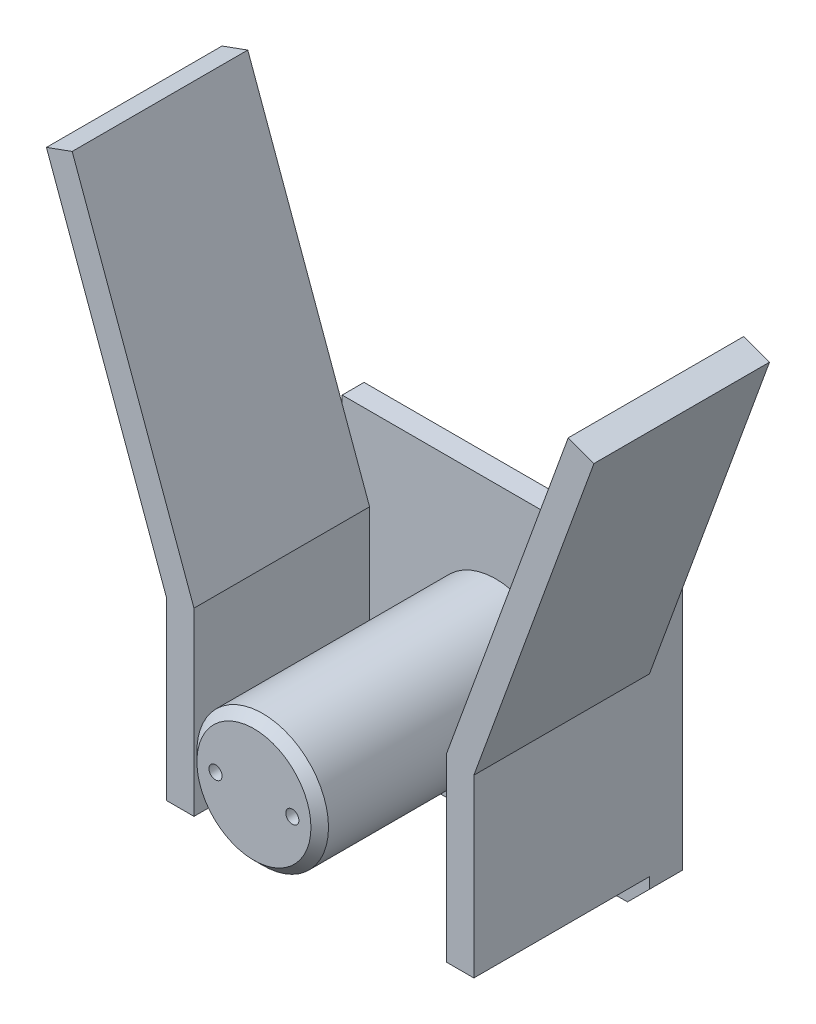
ISO-10303-21;
HEADER;
FILE_DESCRIPTION(('STEP AP214'),'2;1');
FILE_NAME('part.step','',(''),(''),'','','');
FILE_SCHEMA(('AUTOMOTIVE_DESIGN { 1 0 10303 214 1 1 1 1 }'));
ENDSEC;
DATA;
#1=APPLICATION_CONTEXT('core data for automotive mechanical design processes');
#2=APPLICATION_PROTOCOL_DEFINITION('international standard','automotive_design',2000,#1);
#3=PRODUCT_CONTEXT('',#1,'mechanical');
#4=PRODUCT('Part','Part','',(#3));
#5=PRODUCT_RELATED_PRODUCT_CATEGORY('part','',(#4));
#6=PRODUCT_DEFINITION_FORMATION('','',#4);
#7=PRODUCT_DEFINITION_CONTEXT('part definition',#1,'design');
#8=PRODUCT_DEFINITION('design','',#6,#7);
#9=PRODUCT_DEFINITION_SHAPE('','',#8);
#10=(LENGTH_UNIT() NAMED_UNIT(*) SI_UNIT(.MILLI.,.METRE.));
#11=(NAMED_UNIT(*) PLANE_ANGLE_UNIT() SI_UNIT($,.RADIAN.));
#12=(NAMED_UNIT(*) SI_UNIT($,.STERADIAN.) SOLID_ANGLE_UNIT());
#13=UNCERTAINTY_MEASURE_WITH_UNIT(LENGTH_MEASURE(1.E-05),#10,'distance_accuracy_value','');
#14=(GEOMETRIC_REPRESENTATION_CONTEXT(3) GLOBAL_UNCERTAINTY_ASSIGNED_CONTEXT((#13)) GLOBAL_UNIT_ASSIGNED_CONTEXT((#10,
#11,#12)) REPRESENTATION_CONTEXT('',''));
#15=CARTESIAN_POINT('',(0.,0.,0.));
#16=DIRECTION('',(0.,0.,1.));
#17=DIRECTION('',(1.,0.,0.));
#18=AXIS2_PLACEMENT_3D('',#15,#16,#17);
#19=CARTESIAN_POINT('',(-44.45,-85.725,9.525));
#20=DIRECTION('',(0.,0.,1.));
#21=DIRECTION('',(1.,0.,0.));
#22=AXIS2_PLACEMENT_3D('',#19,#20,#21);
#23=PLANE('',#22);
#24=DIRECTION('',(0.342020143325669,0.939692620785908,0.));
#25=VECTOR('',#24,1.);
#26=CARTESIAN_POINT('',(71.7523704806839,72.7832115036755,9.525));
#27=LINE('',#26,#25);
#28=CARTESIAN_POINT('',(36.51504,-24.0305583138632,9.525));
#29=VERTEX_POINT('',#28);
#30=CARTESIAN_POINT('',(44.45,-2.22943488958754,9.525));
#31=VERTEX_POINT('',#30);
#32=EDGE_CURVE('E198',#29,#31,#27,.T.);
#33=ORIENTED_EDGE('',*,*,#32,.T.);
#34=DIRECTION('',(0.,1.,0.));
#35=VECTOR('',#34,1.);
#36=CARTESIAN_POINT('',(44.45,0.,9.525));
#37=LINE('',#36,#35);
#38=CARTESIAN_POINT('',(44.45,0.,9.525));
#39=VERTEX_POINT('',#38);
#40=EDGE_CURVE('E328',#31,#39,#37,.T.);
#41=ORIENTED_EDGE('',*,*,#40,.T.);
#42=DIRECTION('',(-1.,0.,0.));
#43=VECTOR('',#42,1.);
#44=CARTESIAN_POINT('',(-44.45,0.,9.525));
#45=LINE('',#44,#43);
#46=CARTESIAN_POINT('',(-44.45,0.,9.525));
#47=VERTEX_POINT('',#46);
#48=EDGE_CURVE('E331',#39,#47,#45,.T.);
#49=ORIENTED_EDGE('',*,*,#48,.T.);
#50=DIRECTION('',(0.,-1.,0.));
#51=VECTOR('',#50,1.);
#52=CARTESIAN_POINT('',(-44.45,0.,9.525));
#53=LINE('',#52,#51);
#54=CARTESIAN_POINT('',(-44.45,-2.22943488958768,9.525));
#55=VERTEX_POINT('',#54);
#56=EDGE_CURVE('E321',#47,#55,#53,.T.);
#57=ORIENTED_EDGE('',*,*,#56,.T.);
#58=DIRECTION('',(-0.342020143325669,0.939692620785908,0.));
#59=VECTOR('',#58,1.);
#60=CARTESIAN_POINT('',(-71.7523704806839,72.7832115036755,9.525));
#61=LINE('',#60,#59);
#62=CARTESIAN_POINT('',(-36.51504,-24.0305583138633,9.525));
#63=VERTEX_POINT('',#62);
#64=EDGE_CURVE('E234',#63,#55,#61,.T.);
#65=ORIENTED_EDGE('',*,*,#64,.F.);
#66=DIRECTION('',(0.,1.,0.));
#67=VECTOR('',#66,1.);
#68=CARTESIAN_POINT('',(-36.51504,-24.0305583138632,9.525));
#69=LINE('',#68,#67);
#70=CARTESIAN_POINT('',(-36.51504,-76.2,9.525));
#71=VERTEX_POINT('',#70);
#72=EDGE_CURVE('E230',#71,#63,#69,.T.);
#73=ORIENTED_EDGE('',*,*,#72,.F.);
#74=DIRECTION('',(1.,0.,0.));
#75=VECTOR('',#74,1.);
#76=CARTESIAN_POINT('',(-44.45,-76.2,9.525));
#77=LINE('',#76,#75);
#78=CARTESIAN_POINT('',(-44.45,-76.2,9.525));
#79=VERTEX_POINT('',#78);
#80=EDGE_CURVE('E227',#79,#71,#77,.T.);
#81=ORIENTED_EDGE('',*,*,#80,.F.);
#82=CARTESIAN_POINT('',(-44.45,-79.3749999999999,9.525));
#83=VERTEX_POINT('',#82);
#84=EDGE_CURVE('E320',#79,#83,#53,.T.);
#85=ORIENTED_EDGE('',*,*,#84,.T.);
#86=DIRECTION('',(-0.70710678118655,0.707106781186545,0.));
#87=VECTOR('',#86,1.);
#88=CARTESIAN_POINT('',(-41.2749999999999,-82.5499999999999,9.525));
#89=LINE('',#88,#87);
#90=CARTESIAN_POINT('',(-38.0999999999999,-85.725,9.525));
#91=VERTEX_POINT('',#90);
#92=EDGE_CURVE('E353',#83,#91,#89,.F.);
#93=ORIENTED_EDGE('',*,*,#92,.T.);
#94=DIRECTION('',(1.,0.,0.));
#95=VECTOR('',#94,1.);
#96=CARTESIAN_POINT('',(-44.45,-85.725,9.525));
#97=LINE('',#96,#95);
#98=CARTESIAN_POINT('',(38.0999999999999,-85.725,9.525));
#99=VERTEX_POINT('',#98);
#100=EDGE_CURVE('E324',#91,#99,#97,.T.);
#101=ORIENTED_EDGE('',*,*,#100,.T.);
#102=DIRECTION('',(-0.707106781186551,-0.707106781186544,0.));
#103=VECTOR('',#102,1.);
#104=CARTESIAN_POINT('',(-3.17500000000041,-127.,9.525));
#105=LINE('',#104,#103);
#106=CARTESIAN_POINT('',(44.45,-79.3749999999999,9.525));
#107=VERTEX_POINT('',#106);
#108=EDGE_CURVE('E355',#99,#107,#105,.F.);
#109=ORIENTED_EDGE('',*,*,#108,.T.);
#110=CARTESIAN_POINT('',(44.45,-76.2,9.525));
#111=VERTEX_POINT('',#110);
#112=EDGE_CURVE('E329',#107,#111,#37,.T.);
#113=ORIENTED_EDGE('',*,*,#112,.T.);
#114=DIRECTION('',(-1.,0.,0.));
#115=VECTOR('',#114,1.);
#116=CARTESIAN_POINT('',(44.45,-76.2,9.525));
#117=LINE('',#116,#115);
#118=CARTESIAN_POINT('',(36.51504,-76.2,9.525));
#119=VERTEX_POINT('',#118);
#120=EDGE_CURVE('E50',#111,#119,#117,.T.);
#121=ORIENTED_EDGE('',*,*,#120,.T.);
#122=DIRECTION('',(0.,1.,0.));
#123=VECTOR('',#122,1.);
#124=CARTESIAN_POINT('',(36.51504,-24.0305583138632,9.525));
#125=LINE('',#124,#123);
#126=EDGE_CURVE('E45',#119,#29,#125,.T.);
#127=ORIENTED_EDGE('',*,*,#126,.T.);
#128=EDGE_LOOP('',(#33,#41,#49,#57,#65,#73,#81,#85,#93,#101,#109,#113,#121,#127));
#129=FACE_BOUND('',#128,.T.);
#130=CARTESIAN_POINT('',(0.,-42.8625,9.525));
#131=DIRECTION('',(0.,0.,1.));
#132=DIRECTION('',(1.,0.,0.));
#133=AXIS2_PLACEMENT_3D('',#130,#131,#132);
#134=CIRCLE('',#133,19.0373);
#135=CARTESIAN_POINT('',(19.0373,-42.8625,9.525));
#136=VERTEX_POINT('',#135);
#137=EDGE_CURVE('E309',#136,#136,#134,.T.);
#138=ORIENTED_EDGE('',*,*,#137,.F.);
#139=EDGE_LOOP('',(#138));
#140=FACE_BOUND('',#139,.T.);
#141=CARTESIAN_POINT('',(-31.75,-77.7875,9.525));
#142=DIRECTION('',(0.,0.,1.));
#143=DIRECTION('',(1.,0.,0.));
#144=AXIS2_PLACEMENT_3D('',#141,#142,#143);
#145=CIRCLE('',#144,3.556);
#146=CARTESIAN_POINT('',(-28.194,-77.7875,9.525));
#147=VERTEX_POINT('',#146);
#148=EDGE_CURVE('E291',#147,#147,#145,.T.);
#149=ORIENTED_EDGE('',*,*,#148,.F.);
#150=EDGE_LOOP('',(#149));
#151=FACE_BOUND('',#150,.T.);
#152=CARTESIAN_POINT('',(31.75,-77.7875,9.525));
#153=DIRECTION('',(0.,0.,1.));
#154=DIRECTION('',(-1.,0.,0.));
#155=AXIS2_PLACEMENT_3D('',#152,#153,#154);
#156=CIRCLE('',#155,3.55600000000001);
#157=CARTESIAN_POINT('',(35.306,-77.7875,9.525));
#158=VERTEX_POINT('',#157);
#159=EDGE_CURVE('E285',#158,#158,#156,.T.);
#160=ORIENTED_EDGE('',*,*,#159,.F.);
#161=EDGE_LOOP('',(#160));
#162=FACE_BOUND('',#161,.T.);
#163=CARTESIAN_POINT('',(-31.75,-55.5625,9.525));
#164=DIRECTION('',(0.,0.,1.));
#165=DIRECTION('',(1.,0.,0.));
#166=AXIS2_PLACEMENT_3D('',#163,#164,#165);
#167=CIRCLE('',#166,3.556);
#168=CARTESIAN_POINT('',(-28.194,-55.5625,9.525));
#169=VERTEX_POINT('',#168);
#170=EDGE_CURVE('E279',#169,#169,#167,.T.);
#171=ORIENTED_EDGE('',*,*,#170,.F.);
#172=EDGE_LOOP('',(#171));
#173=FACE_BOUND('',#172,.T.);
#174=CARTESIAN_POINT('',(31.75,-55.5625,9.525));
#175=DIRECTION('',(0.,0.,1.));
#176=DIRECTION('',(-1.,0.,0.));
#177=AXIS2_PLACEMENT_3D('',#174,#175,#176);
#178=CIRCLE('',#177,3.55600000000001);
#179=CARTESIAN_POINT('',(35.306,-55.5625,9.525));
#180=VERTEX_POINT('',#179);
#181=EDGE_CURVE('E273',#180,#180,#178,.T.);
#182=ORIENTED_EDGE('',*,*,#181,.F.);
#183=EDGE_LOOP('',(#182));
#184=FACE_BOUND('',#183,.T.);
#185=ADVANCED_FACE('F30',(#129,#140,#151,#162,#173,#184),#23,.T.);
#186=CARTESIAN_POINT('',(-44.45,0.,9.525));
#187=DIRECTION('',(1.,0.,0.));
#188=DIRECTION('',(0.,1.,0.));
#189=AXIS2_PLACEMENT_3D('',#186,#187,#188);
#190=PLANE('',#189);
#191=DIRECTION('',(0.,0.,-1.));
#192=VECTOR('',#191,1.);
#193=CARTESIAN_POINT('',(-44.45,0.,9.525));
#194=LINE('',#193,#192);
#195=CARTESIAN_POINT('',(-44.45,0.,3.175));
#196=VERTEX_POINT('',#195);
#197=EDGE_CURVE('E334',#47,#196,#194,.T.);
#198=ORIENTED_EDGE('',*,*,#197,.T.);
#199=DIRECTION('',(0.,0.707106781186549,0.707106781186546));
#200=VECTOR('',#199,1.);
#201=CARTESIAN_POINT('',(-44.45,0.,3.175));
#202=LINE('',#201,#200);
#203=CARTESIAN_POINT('',(-44.45,-3.17500000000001,0.));
#204=VERTEX_POINT('',#203);
#205=EDGE_CURVE('E363',#196,#204,#202,.F.);
#206=ORIENTED_EDGE('',*,*,#205,.T.);
#207=DIRECTION('',(0.,-1.,0.));
#208=VECTOR('',#207,1.);
#209=CARTESIAN_POINT('',(-44.45,0.,0.));
#210=LINE('',#209,#208);
#211=CARTESIAN_POINT('',(-44.45,-79.3749999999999,0.));
#212=VERTEX_POINT('',#211);
#213=EDGE_CURVE('E312',#204,#212,#210,.T.);
#214=ORIENTED_EDGE('',*,*,#213,.T.);
#215=DIRECTION('',(0.,0.,1.));
#216=VECTOR('',#215,1.);
#217=CARTESIAN_POINT('',(-44.45,-79.3749999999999,9.525));
#218=LINE('',#217,#216);
#219=EDGE_CURVE('E357',#212,#83,#218,.T.);
#220=ORIENTED_EDGE('',*,*,#219,.T.);
#221=ORIENTED_EDGE('',*,*,#84,.F.);
#222=DIRECTION('',(0.,0.,-1.));
#223=VECTOR('',#222,1.);
#224=CARTESIAN_POINT('',(-44.45,-76.2,60.325));
#225=LINE('',#224,#223);
#226=CARTESIAN_POINT('',(-44.45,-76.2,60.325));
#227=VERTEX_POINT('',#226);
#228=EDGE_CURVE('E270',#227,#79,#225,.T.);
#229=ORIENTED_EDGE('',*,*,#228,.F.);
#230=DIRECTION('',(0.,-1.,0.));
#231=VECTOR('',#230,1.);
#232=CARTESIAN_POINT('',(-44.45,-25.4,60.325));
#233=LINE('',#232,#231);
#234=CARTESIAN_POINT('',(-44.45,-25.4,60.325));
#235=VERTEX_POINT('',#234);
#236=EDGE_CURVE('E242',#235,#227,#233,.T.);
#237=ORIENTED_EDGE('',*,*,#236,.F.);
#238=DIRECTION('',(0.,0.,-1.));
#239=VECTOR('',#238,1.);
#240=CARTESIAN_POINT('',(-44.45,-25.4,60.325));
#241=LINE('',#240,#239);
#242=CARTESIAN_POINT('',(-44.45,-25.4,9.525));
#243=VERTEX_POINT('',#242);
#244=EDGE_CURVE('E255',#235,#243,#241,.T.);
#245=ORIENTED_EDGE('',*,*,#244,.T.);
#246=EDGE_CURVE('E325',#55,#243,#53,.T.);
#247=ORIENTED_EDGE('',*,*,#246,.F.);
#248=ORIENTED_EDGE('',*,*,#56,.F.);
#249=EDGE_LOOP('',(#198,#206,#214,#220,#221,#229,#237,#245,#247,#248));
#250=FACE_BOUND('',#249,.T.);
#251=ADVANCED_FACE('F32',(#250),#190,.F.);
#252=CARTESIAN_POINT('',(-44.45,-85.725,9.525));
#253=DIRECTION('',(0.,1.,0.));
#254=DIRECTION('',(-1.,0.,0.));
#255=AXIS2_PLACEMENT_3D('',#252,#253,#254);
#256=PLANE('',#255);
#257=DIRECTION('',(1.,0.,0.));
#258=VECTOR('',#257,1.);
#259=CARTESIAN_POINT('',(-44.45,-85.725,0.));
#260=LINE('',#259,#258);
#261=CARTESIAN_POINT('',(-38.0999999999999,-85.725,0.));
#262=VERTEX_POINT('',#261);
#263=CARTESIAN_POINT('',(38.0999999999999,-85.725,0.));
#264=VERTEX_POINT('',#263);
#265=EDGE_CURVE('E314',#262,#264,#260,.T.);
#266=ORIENTED_EDGE('',*,*,#265,.T.);
#267=DIRECTION('',(0.,0.,1.));
#268=VECTOR('',#267,1.);
#269=CARTESIAN_POINT('',(38.0999999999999,-85.725,9.525));
#270=LINE('',#269,#268);
#271=EDGE_CURVE('E351',#264,#99,#270,.T.);
#272=ORIENTED_EDGE('',*,*,#271,.T.);
#273=ORIENTED_EDGE('',*,*,#100,.F.);
#274=DIRECTION('',(0.,0.,-1.));
#275=VECTOR('',#274,1.);
#276=CARTESIAN_POINT('',(-38.0999999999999,-85.725,9.525));
#277=LINE('',#276,#275);
#278=EDGE_CURVE('E348',#91,#262,#277,.T.);
#279=ORIENTED_EDGE('',*,*,#278,.T.);
#280=EDGE_LOOP('',(#266,#272,#273,#279));
#281=FACE_BOUND('',#280,.T.);
#282=ADVANCED_FACE('F399',(#281),#256,.F.);
#283=CARTESIAN_POINT('',(44.45,0.,9.525));
#284=DIRECTION('',(-1.,0.,0.));
#285=DIRECTION('',(0.,-1.,0.));
#286=AXIS2_PLACEMENT_3D('',#283,#284,#285);
#287=PLANE('',#286);
#288=DIRECTION('',(0.,1.,0.));
#289=VECTOR('',#288,1.);
#290=CARTESIAN_POINT('',(44.45,0.,0.));
#291=LINE('',#290,#289);
#292=CARTESIAN_POINT('',(44.45,-79.3749999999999,0.));
#293=VERTEX_POINT('',#292);
#294=CARTESIAN_POINT('',(44.45,-3.175,0.));
#295=VERTEX_POINT('',#294);
#296=EDGE_CURVE('E317',#293,#295,#291,.T.);
#297=ORIENTED_EDGE('',*,*,#296,.T.);
#298=DIRECTION('',(0.,-0.707106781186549,-0.707106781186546));
#299=VECTOR('',#298,1.);
#300=CARTESIAN_POINT('',(44.45,0.,3.175));
#301=LINE('',#300,#299);
#302=CARTESIAN_POINT('',(44.45,0.,3.175));
#303=VERTEX_POINT('',#302);
#304=EDGE_CURVE('E367',#295,#303,#301,.F.);
#305=ORIENTED_EDGE('',*,*,#304,.T.);
#306=DIRECTION('',(0.,0.,-1.));
#307=VECTOR('',#306,1.);
#308=CARTESIAN_POINT('',(44.45,0.,9.525));
#309=LINE('',#308,#307);
#310=EDGE_CURVE('E337',#39,#303,#309,.T.);
#311=ORIENTED_EDGE('',*,*,#310,.F.);
#312=ORIENTED_EDGE('',*,*,#40,.F.);
#313=CARTESIAN_POINT('',(44.45,-25.4,9.525));
#314=VERTEX_POINT('',#313);
#315=EDGE_CURVE('E332',#314,#31,#37,.T.);
#316=ORIENTED_EDGE('',*,*,#315,.F.);
#317=DIRECTION('',(0.,0.,-1.));
#318=VECTOR('',#317,1.);
#319=CARTESIAN_POINT('',(44.45,-25.4,60.325));
#320=LINE('',#319,#318);
#321=CARTESIAN_POINT('',(44.45,-25.4,60.325));
#322=VERTEX_POINT('',#321);
#323=EDGE_CURVE('E183',#322,#314,#320,.T.);
#324=ORIENTED_EDGE('',*,*,#323,.F.);
#325=DIRECTION('',(0.,-1.,0.));
#326=VECTOR('',#325,1.);
#327=CARTESIAN_POINT('',(44.45,-25.4,60.325));
#328=LINE('',#327,#326);
#329=CARTESIAN_POINT('',(44.45,-76.2,60.325));
#330=VERTEX_POINT('',#329);
#331=EDGE_CURVE('E203',#322,#330,#328,.T.);
#332=ORIENTED_EDGE('',*,*,#331,.T.);
#333=DIRECTION('',(0.,0.,-1.));
#334=VECTOR('',#333,1.);
#335=CARTESIAN_POINT('',(44.45,-76.2,60.325));
#336=LINE('',#335,#334);
#337=EDGE_CURVE('E218',#330,#111,#336,.T.);
#338=ORIENTED_EDGE('',*,*,#337,.T.);
#339=ORIENTED_EDGE('',*,*,#112,.F.);
#340=DIRECTION('',(0.,0.,-1.));
#341=VECTOR('',#340,1.);
#342=CARTESIAN_POINT('',(44.45,-79.3749999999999,9.525));
#343=LINE('',#342,#341);
#344=EDGE_CURVE('E340',#107,#293,#343,.T.);
#345=ORIENTED_EDGE('',*,*,#344,.T.);
#346=EDGE_LOOP('',(#297,#305,#311,#312,#316,#324,#332,#338,#339,#345));
#347=FACE_BOUND('',#346,.T.);
#348=ADVANCED_FACE('F409',(#347),#287,.F.);
#349=CARTESIAN_POINT('',(-44.45,0.,9.525));
#350=DIRECTION('',(0.,-1.,0.));
#351=DIRECTION('',(1.,0.,0.));
#352=AXIS2_PLACEMENT_3D('',#349,#350,#351);
#353=PLANE('',#352);
#354=ORIENTED_EDGE('',*,*,#310,.T.);
#355=DIRECTION('',(-1.,0.,0.));
#356=VECTOR('',#355,1.);
#357=CARTESIAN_POINT('',(-44.45,0.,3.175));
#358=LINE('',#357,#356);
#359=EDGE_CURVE('E360',#303,#196,#358,.T.);
#360=ORIENTED_EDGE('',*,*,#359,.T.);
#361=ORIENTED_EDGE('',*,*,#197,.F.);
#362=ORIENTED_EDGE('',*,*,#48,.F.);
#363=EDGE_LOOP('',(#354,#360,#361,#362));
#364=FACE_BOUND('',#363,.T.);
#365=ADVANCED_FACE('F406',(#364),#353,.F.);
#366=CARTESIAN_POINT('',(-44.45,-85.725,0.));
#367=DIRECTION('',(0.,0.,1.));
#368=DIRECTION('',(1.,0.,0.));
#369=AXIS2_PLACEMENT_3D('',#366,#367,#368);
#370=PLANE('',#369);
#371=CARTESIAN_POINT('',(31.75,-55.5625,0.));
#372=DIRECTION('',(0.,0.,1.));
#373=DIRECTION('',(-1.,0.,0.));
#374=AXIS2_PLACEMENT_3D('',#371,#372,#373);
#375=CIRCLE('',#374,3.55600000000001);
#376=CARTESIAN_POINT('',(35.306,-55.5625,0.));
#377=VERTEX_POINT('',#376);
#378=EDGE_CURVE('E276',#377,#377,#375,.T.);
#379=ORIENTED_EDGE('',*,*,#378,.T.);
#380=EDGE_LOOP('',(#379));
#381=FACE_BOUND('',#380,.T.);
#382=CARTESIAN_POINT('',(-31.75,-55.5625,0.));
#383=DIRECTION('',(0.,0.,1.));
#384=DIRECTION('',(1.,0.,0.));
#385=AXIS2_PLACEMENT_3D('',#382,#383,#384);
#386=CIRCLE('',#385,3.556);
#387=CARTESIAN_POINT('',(-28.194,-55.5625,0.));
#388=VERTEX_POINT('',#387);
#389=EDGE_CURVE('E282',#388,#388,#386,.T.);
#390=ORIENTED_EDGE('',*,*,#389,.T.);
#391=EDGE_LOOP('',(#390));
#392=FACE_BOUND('',#391,.T.);
#393=CARTESIAN_POINT('',(31.75,-77.7875,0.));
#394=DIRECTION('',(0.,0.,1.));
#395=DIRECTION('',(-1.,0.,0.));
#396=AXIS2_PLACEMENT_3D('',#393,#394,#395);
#397=CIRCLE('',#396,3.55600000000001);
#398=CARTESIAN_POINT('',(35.306,-77.7875,0.));
#399=VERTEX_POINT('',#398);
#400=EDGE_CURVE('E288',#399,#399,#397,.T.);
#401=ORIENTED_EDGE('',*,*,#400,.T.);
#402=EDGE_LOOP('',(#401));
#403=FACE_BOUND('',#402,.T.);
#404=CARTESIAN_POINT('',(-31.75,-77.7875,0.));
#405=DIRECTION('',(0.,0.,1.));
#406=DIRECTION('',(1.,0.,0.));
#407=AXIS2_PLACEMENT_3D('',#404,#405,#406);
#408=CIRCLE('',#407,3.556);
#409=CARTESIAN_POINT('',(-28.194,-77.7875,0.));
#410=VERTEX_POINT('',#409);
#411=EDGE_CURVE('E294',#410,#410,#408,.T.);
#412=ORIENTED_EDGE('',*,*,#411,.T.);
#413=EDGE_LOOP('',(#412));
#414=FACE_BOUND('',#413,.T.);
#415=ORIENTED_EDGE('',*,*,#213,.F.);
#416=DIRECTION('',(1.,0.,0.));
#417=VECTOR('',#416,1.);
#418=CARTESIAN_POINT('',(-44.45,-3.17500000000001,0.));
#419=LINE('',#418,#417);
#420=EDGE_CURVE('E365',#204,#295,#419,.T.);
#421=ORIENTED_EDGE('',*,*,#420,.T.);
#422=ORIENTED_EDGE('',*,*,#296,.F.);
#423=DIRECTION('',(0.707106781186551,0.707106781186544,0.));
#424=VECTOR('',#423,1.);
#425=CARTESIAN_POINT('',(44.45,-79.3749999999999,0.));
#426=LINE('',#425,#424);
#427=EDGE_CURVE('E346',#293,#264,#426,.F.);
#428=ORIENTED_EDGE('',*,*,#427,.T.);
#429=ORIENTED_EDGE('',*,*,#265,.F.);
#430=DIRECTION('',(0.70710678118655,-0.707106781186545,0.));
#431=VECTOR('',#430,1.);
#432=CARTESIAN_POINT('',(-38.0999999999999,-85.725,0.));
#433=LINE('',#432,#431);
#434=EDGE_CURVE('E343',#262,#212,#433,.F.);
#435=ORIENTED_EDGE('',*,*,#434,.T.);
#436=EDGE_LOOP('',(#415,#421,#422,#428,#429,#435));
#437=FACE_BOUND('',#436,.T.);
#438=ADVANCED_FACE('F404',(#381,#392,#403,#414,#437),#370,.F.);
#439=CARTESIAN_POINT('',(0.,-42.8625,79.502));
#440=DIRECTION('',(0.,0.,-1.));
#441=DIRECTION('',(-1.,0.,0.));
#442=AXIS2_PLACEMENT_3D('',#439,#440,#441);
#443=CYLINDRICAL_SURFACE('',#442,19.0373);
#444=CARTESIAN_POINT('',(0.,-42.8625,76.962));
#445=DIRECTION('',(0.,0.,1.));
#446=DIRECTION('',(1.,0.,0.));
#447=AXIS2_PLACEMENT_3D('',#444,#445,#446);
#448=CIRCLE('',#447,19.0373);
#449=CARTESIAN_POINT('',(19.0373,-42.8625,76.962));
#450=VERTEX_POINT('',#449);
#451=EDGE_CURVE('E11',#450,#450,#448,.F.);
#452=ORIENTED_EDGE('',*,*,#451,.T.);
#453=EDGE_LOOP('',(#452));
#454=FACE_BOUND('',#453,.T.);
#455=ORIENTED_EDGE('',*,*,#137,.T.);
#456=EDGE_LOOP('',(#455));
#457=FACE_BOUND('',#456,.T.);
#458=ADVANCED_FACE('F470',(#454,#457),#443,.T.);
#459=CARTESIAN_POINT('',(0.,-42.8625,79.502));
#460=DIRECTION('',(0.,0.,1.));
#461=DIRECTION('',(1.,0.,0.));
#462=AXIS2_PLACEMENT_3D('',#459,#460,#461);
#463=PLANE('',#462);
#464=CARTESIAN_POINT('',(-11.1125,-42.8624999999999,79.5019999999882));
#465=DIRECTION('',(0.,0.,1.));
#466=DIRECTION('',(1.,0.,0.));
#467=AXIS2_PLACEMENT_3D('',#464,#465,#466);
#468=CIRCLE('',#467,1.89864835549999);
#469=CARTESIAN_POINT('',(-9.21385164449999,-42.8624999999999,79.5019999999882));
#470=VERTEX_POINT('',#469);
#471=EDGE_CURVE('E300',#470,#470,#468,.T.);
#472=ORIENTED_EDGE('',*,*,#471,.F.);
#473=EDGE_LOOP('',(#472));
#474=FACE_BOUND('',#473,.T.);
#475=CARTESIAN_POINT('',(11.1125,-42.8625,79.5019999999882));
#476=DIRECTION('',(0.,0.,1.));
#477=DIRECTION('',(1.,0.,0.));
#478=AXIS2_PLACEMENT_3D('',#475,#476,#477);
#479=CIRCLE('',#478,1.89864835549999);
#480=CARTESIAN_POINT('',(13.0111483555,-42.8625,79.5019999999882));
#481=VERTEX_POINT('',#480);
#482=EDGE_CURVE('E306',#481,#481,#479,.T.);
#483=ORIENTED_EDGE('',*,*,#482,.F.);
#484=EDGE_LOOP('',(#483));
#485=FACE_BOUND('',#484,.T.);
#486=CARTESIAN_POINT('',(0.,-42.8625,79.502));
#487=DIRECTION('',(0.,0.,1.));
#488=DIRECTION('',(1.,0.,0.));
#489=AXIS2_PLACEMENT_3D('',#486,#487,#488);
#490=CIRCLE('',#489,16.4973);
#491=CARTESIAN_POINT('',(16.4973,-42.8625,79.502));
#492=VERTEX_POINT('',#491);
#493=EDGE_CURVE('E38',#492,#492,#490,.T.);
#494=ORIENTED_EDGE('',*,*,#493,.T.);
#495=EDGE_LOOP('',(#494));
#496=FACE_BOUND('',#495,.T.);
#497=ADVANCED_FACE('F371',(#474,#485,#496),#463,.T.);
#498=CARTESIAN_POINT('',(44.45,-79.3749999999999,9.525));
#499=DIRECTION('',(-0.707106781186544,0.707106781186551,0.));
#500=DIRECTION('',(-0.707106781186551,-0.707106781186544,0.));
#501=AXIS2_PLACEMENT_3D('',#498,#499,#500);
#502=PLANE('',#501);
#503=ORIENTED_EDGE('',*,*,#108,.F.);
#504=ORIENTED_EDGE('',*,*,#271,.F.);
#505=ORIENTED_EDGE('',*,*,#427,.F.);
#506=ORIENTED_EDGE('',*,*,#344,.F.);
#507=EDGE_LOOP('',(#503,#504,#505,#506));
#508=FACE_BOUND('',#507,.T.);
#509=ADVANCED_FACE('F424',(#508),#502,.F.);
#510=CARTESIAN_POINT('',(-38.0999999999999,-85.725,9.525));
#511=DIRECTION('',(0.707106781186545,0.70710678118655,0.));
#512=DIRECTION('',(-0.70710678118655,0.707106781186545,0.));
#513=AXIS2_PLACEMENT_3D('',#510,#511,#512);
#514=PLANE('',#513);
#515=ORIENTED_EDGE('',*,*,#92,.F.);
#516=ORIENTED_EDGE('',*,*,#219,.F.);
#517=ORIENTED_EDGE('',*,*,#434,.F.);
#518=ORIENTED_EDGE('',*,*,#278,.F.);
#519=EDGE_LOOP('',(#515,#516,#517,#518));
#520=FACE_BOUND('',#519,.T.);
#521=ADVANCED_FACE('F388',(#520),#514,.F.);
#522=CARTESIAN_POINT('',(-44.45,0.,3.175));
#523=DIRECTION('',(0.,-0.707106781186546,0.707106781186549));
#524=DIRECTION('',(0.,-0.707106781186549,-0.707106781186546));
#525=AXIS2_PLACEMENT_3D('',#522,#523,#524);
#526=PLANE('',#525);
#527=ORIENTED_EDGE('',*,*,#304,.F.);
#528=ORIENTED_EDGE('',*,*,#420,.F.);
#529=ORIENTED_EDGE('',*,*,#205,.F.);
#530=ORIENTED_EDGE('',*,*,#359,.F.);
#531=EDGE_LOOP('',(#527,#528,#529,#530));
#532=FACE_BOUND('',#531,.T.);
#533=ADVANCED_FACE('F376',(#532),#526,.F.);
#534=CARTESIAN_POINT('',(0.,-42.8625,79.502));
#535=DIRECTION('',(0.,0.,-1.));
#536=DIRECTION('',(-1.,0.,0.));
#537=AXIS2_PLACEMENT_3D('',#534,#535,#536);
#538=CONICAL_SURFACE('',#537,16.4973,0.785398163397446);
#539=ORIENTED_EDGE('',*,*,#451,.F.);
#540=EDGE_LOOP('',(#539));
#541=FACE_BOUND('',#540,.T.);
#542=ORIENTED_EDGE('',*,*,#493,.F.);
#543=EDGE_LOOP('',(#542));
#544=FACE_BOUND('',#543,.T.);
#545=ADVANCED_FACE('F373',(#541,#544),#538,.T.);
#546=CARTESIAN_POINT('',(11.1125,-42.8625,79.5019999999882));
#547=DIRECTION('',(0.,0.,1.));
#548=DIRECTION('',(1.,0.,0.));
#549=AXIS2_PLACEMENT_3D('',#546,#547,#548);
#550=CYLINDRICAL_SURFACE('',#549,1.89864835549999);
#551=CARTESIAN_POINT('',(11.1125,-42.8625,60.4519911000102));
#552=DIRECTION('',(0.,0.,1.));
#553=DIRECTION('',(1.,0.,0.));
#554=AXIS2_PLACEMENT_3D('',#551,#552,#553);
#555=CIRCLE('',#554,1.8986483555);
#556=CARTESIAN_POINT('',(13.0111483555,-42.8625,60.4519911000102));
#557=VERTEX_POINT('',#556);
#558=EDGE_CURVE('E303',#557,#557,#555,.T.);
#559=ORIENTED_EDGE('',*,*,#558,.F.);
#560=EDGE_LOOP('',(#559));
#561=FACE_BOUND('',#560,.T.);
#562=ORIENTED_EDGE('',*,*,#482,.T.);
#563=EDGE_LOOP('',(#562));
#564=FACE_BOUND('',#563,.T.);
#565=ADVANCED_FACE('F375',(#561,#564),#550,.F.);
#566=CARTESIAN_POINT('',(11.1125,-42.8625,60.4519911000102));
#567=DIRECTION('',(0.,0.,1.));
#568=DIRECTION('',(1.,0.,0.));
#569=AXIS2_PLACEMENT_3D('',#566,#567,#568);
#570=CONICAL_SURFACE('',#569,1.8986483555,1.02974425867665);
#571=CARTESIAN_POINT('',(11.1125,-42.8625,59.3111680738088));
#572=VERTEX_POINT('',#571);
#573=VERTEX_LOOP('',#572);
#574=FACE_BOUND('',#573,.T.);
#575=ORIENTED_EDGE('',*,*,#558,.T.);
#576=EDGE_LOOP('',(#575));
#577=FACE_BOUND('',#576,.T.);
#578=ADVANCED_FACE('F384',(#574,#577),#570,.F.);
#579=CARTESIAN_POINT('',(-11.1125,-42.8624999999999,79.5019999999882));
#580=DIRECTION('',(0.,0.,1.));
#581=DIRECTION('',(1.,0.,0.));
#582=AXIS2_PLACEMENT_3D('',#579,#580,#581);
#583=CYLINDRICAL_SURFACE('',#582,1.89864835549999);
#584=CARTESIAN_POINT('',(-11.1125,-42.8624999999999,60.4519911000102));
#585=DIRECTION('',(0.,0.,1.));
#586=DIRECTION('',(1.,0.,0.));
#587=AXIS2_PLACEMENT_3D('',#584,#585,#586);
#588=CIRCLE('',#587,1.8986483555);
#589=CARTESIAN_POINT('',(-9.21385164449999,-42.8624999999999,60.4519911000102));
#590=VERTEX_POINT('',#589);
#591=EDGE_CURVE('E297',#590,#590,#588,.T.);
#592=ORIENTED_EDGE('',*,*,#591,.F.);
#593=EDGE_LOOP('',(#592));
#594=FACE_BOUND('',#593,.T.);
#595=ORIENTED_EDGE('',*,*,#471,.T.);
#596=EDGE_LOOP('',(#595));
#597=FACE_BOUND('',#596,.T.);
#598=ADVANCED_FACE('F518',(#594,#597),#583,.F.);
#599=CARTESIAN_POINT('',(-11.1125,-42.8624999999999,60.4519911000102));
#600=DIRECTION('',(0.,0.,1.));
#601=DIRECTION('',(1.,0.,0.));
#602=AXIS2_PLACEMENT_3D('',#599,#600,#601);
#603=CONICAL_SURFACE('',#602,1.8986483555,1.02974425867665);
#604=CARTESIAN_POINT('',(-11.1125,-42.8624999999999,59.3111680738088));
#605=VERTEX_POINT('',#604);
#606=VERTEX_LOOP('',#605);
#607=FACE_BOUND('',#606,.T.);
#608=ORIENTED_EDGE('',*,*,#591,.T.);
#609=EDGE_LOOP('',(#608));
#610=FACE_BOUND('',#609,.T.);
#611=ADVANCED_FACE('F489',(#607,#610),#603,.F.);
#612=CARTESIAN_POINT('',(-31.75,-77.7875,0.));
#613=DIRECTION('',(0.,0.,1.));
#614=DIRECTION('',(1.,0.,0.));
#615=AXIS2_PLACEMENT_3D('',#612,#613,#614);
#616=CYLINDRICAL_SURFACE('',#615,3.556);
#617=CARTESIAN_POINT('',(-28.194,-77.7875,0.));
#618=CARTESIAN_POINT('',(-28.194,-77.7875,0.0992187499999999));
#619=CARTESIAN_POINT('',(-28.194,-77.7875,0.1984375));
#620=CARTESIAN_POINT('',(-28.194,-77.7875,0.396875));
#621=CARTESIAN_POINT('',(-28.194,-77.7875,0.49609375));
#622=CARTESIAN_POINT('',(-28.194,-77.7875,0.69453125));
#623=CARTESIAN_POINT('',(-28.194,-77.7875,0.79375));
#624=CARTESIAN_POINT('',(-28.194,-77.7875,0.9921875));
#625=CARTESIAN_POINT('',(-28.194,-77.7875,1.09140625));
#626=CARTESIAN_POINT('',(-28.194,-77.7875,1.28984375));
#627=CARTESIAN_POINT('',(-28.194,-77.7875,1.3890625));
#628=CARTESIAN_POINT('',(-28.194,-77.7875,1.5875));
#629=CARTESIAN_POINT('',(-28.194,-77.7875,1.68671875));
#630=CARTESIAN_POINT('',(-28.194,-77.7875,1.88515625));
#631=CARTESIAN_POINT('',(-28.194,-77.7875,1.984375));
#632=CARTESIAN_POINT('',(-28.194,-77.7875,2.1828125));
#633=CARTESIAN_POINT('',(-28.194,-77.7875,2.28203125));
#634=CARTESIAN_POINT('',(-28.194,-77.7875,2.48046875));
#635=CARTESIAN_POINT('',(-28.194,-77.7875,2.5796875));
#636=CARTESIAN_POINT('',(-28.194,-77.7875,2.778125));
#637=CARTESIAN_POINT('',(-28.194,-77.7875,2.87734375));
#638=CARTESIAN_POINT('',(-28.194,-77.7875,3.07578125));
#639=CARTESIAN_POINT('',(-28.194,-77.7875,3.175));
#640=CARTESIAN_POINT('',(-28.194,-77.7875,3.3734375));
#641=CARTESIAN_POINT('',(-28.194,-77.7875,3.47265625));
#642=CARTESIAN_POINT('',(-28.194,-77.7875,3.67109375));
#643=CARTESIAN_POINT('',(-28.194,-77.7875,3.7703125));
#644=CARTESIAN_POINT('',(-28.194,-77.7875,3.96875));
#645=CARTESIAN_POINT('',(-28.194,-77.7875,4.06796875));
#646=CARTESIAN_POINT('',(-28.194,-77.7875,4.26640625));
#647=CARTESIAN_POINT('',(-28.194,-77.7875,4.365625));
#648=CARTESIAN_POINT('',(-28.194,-77.7875,4.5640625));
#649=CARTESIAN_POINT('',(-28.194,-77.7875,4.66328125));
#650=CARTESIAN_POINT('',(-28.194,-77.7875,4.86171875));
#651=CARTESIAN_POINT('',(-28.194,-77.7875,4.9609375));
#652=CARTESIAN_POINT('',(-28.194,-77.7875,5.159375));
#653=CARTESIAN_POINT('',(-28.194,-77.7875,5.25859375));
#654=CARTESIAN_POINT('',(-28.194,-77.7875,5.45703125));
#655=CARTESIAN_POINT('',(-28.194,-77.7875,5.55625));
#656=CARTESIAN_POINT('',(-28.194,-77.7875,5.7546875));
#657=CARTESIAN_POINT('',(-28.194,-77.7875,5.85390625));
#658=CARTESIAN_POINT('',(-28.194,-77.7875,6.05234375));
#659=CARTESIAN_POINT('',(-28.194,-77.7875,6.1515625));
#660=CARTESIAN_POINT('',(-28.194,-77.7875,6.35));
#661=CARTESIAN_POINT('',(-28.194,-77.7875,6.44921875));
#662=CARTESIAN_POINT('',(-28.194,-77.7875,6.64765625));
#663=CARTESIAN_POINT('',(-28.194,-77.7875,6.746875));
#664=CARTESIAN_POINT('',(-28.194,-77.7875,6.9453125));
#665=CARTESIAN_POINT('',(-28.194,-77.7875,7.04453125));
#666=CARTESIAN_POINT('',(-28.194,-77.7875,7.24296875));
#667=CARTESIAN_POINT('',(-28.194,-77.7875,7.3421875));
#668=CARTESIAN_POINT('',(-28.194,-77.7875,7.540625));
#669=CARTESIAN_POINT('',(-28.194,-77.7875,7.63984375));
#670=CARTESIAN_POINT('',(-28.194,-77.7875,7.83828125));
#671=CARTESIAN_POINT('',(-28.194,-77.7875,7.9375));
#672=CARTESIAN_POINT('',(-28.194,-77.7875,8.1359375));
#673=CARTESIAN_POINT('',(-28.194,-77.7875,8.23515625));
#674=CARTESIAN_POINT('',(-28.194,-77.7875,8.43359375));
#675=CARTESIAN_POINT('',(-28.194,-77.7875,8.5328125));
#676=CARTESIAN_POINT('',(-28.194,-77.7875,8.73125));
#677=CARTESIAN_POINT('',(-28.194,-77.7875,8.83046875));
#678=CARTESIAN_POINT('',(-28.194,-77.7875,9.02890625));
#679=CARTESIAN_POINT('',(-28.194,-77.7875,9.128125));
#680=CARTESIAN_POINT('',(-28.194,-77.7875,9.3265625));
#681=CARTESIAN_POINT('',(-28.194,-77.7875,9.42578125));
#682=CARTESIAN_POINT('',(-28.194,-77.7875,9.525));
#683=B_SPLINE_CURVE_WITH_KNOTS('',3,(#617,#618,#619,#620,#621,#622,#623,#624,#625,#626,#627,
#628,#629,#630,#631,#632,#633,#634,#635,#636,#637,#638,#639,#640,#641,#642,#643,#644,#645,#646,
#647,#648,#649,#650,#651,#652,#653,#654,#655,#656,#657,#658,#659,#660,#661,#662,#663,#664,#665,
#666,#667,#668,#669,#670,#671,#672,#673,#674,#675,#676,#677,#678,#679,#680,#681,#682),
.UNSPECIFIED.,.F.,.F.,(4,2,2,2,2,2,2,2,2,2,2,2,2,2,2,2,2,2,2,2,2,2,2,2,2,2,2,2,2,2,2,2,4),(0.,
0.29765625,0.5953125,0.89296875,1.190625,1.48828125,1.7859375,2.08359375,2.38125,2.67890625,
2.9765625,3.27421875,3.571875,3.86953125,4.1671875,4.46484375,4.7625,5.06015625,5.3578125,
5.65546875,5.953125,6.25078125,6.5484375,6.84609375,7.14375,7.44140625,7.7390625,8.03671875,
8.334375,8.63203125,8.9296875,9.22734375,9.525),.UNSPECIFIED.);
#684=EDGE_CURVE('BSEAM485',#410,#147,#683,.T.);
#685=ORIENTED_EDGE('',*,*,#411,.F.);
#686=ORIENTED_EDGE('',*,*,#148,.T.);
#687=ORIENTED_EDGE('',*,*,#684,.T.);
#688=ORIENTED_EDGE('',*,*,#684,.F.);
#689=EDGE_LOOP('',(#685,#687,#686,#688));
#690=FACE_BOUND('',#689,.T.);
#691=ADVANCED_FACE('F485',(#690),#616,.F.);
#692=CARTESIAN_POINT('',(31.75,-77.7875,0.));
#693=DIRECTION('',(0.,0.,1.));
#694=DIRECTION('',(1.,0.,0.));
#695=AXIS2_PLACEMENT_3D('',#692,#693,#694);
#696=CYLINDRICAL_SURFACE('',#695,3.55600000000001);
#697=CARTESIAN_POINT('',(35.306,-77.7875,0.));
#698=CARTESIAN_POINT('',(35.306,-77.7875,0.0992187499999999));
#699=CARTESIAN_POINT('',(35.306,-77.7875,0.1984375));
#700=CARTESIAN_POINT('',(35.306,-77.7875,0.396875));
#701=CARTESIAN_POINT('',(35.306,-77.7875,0.49609375));
#702=CARTESIAN_POINT('',(35.306,-77.7875,0.69453125));
#703=CARTESIAN_POINT('',(35.306,-77.7875,0.79375));
#704=CARTESIAN_POINT('',(35.306,-77.7875,0.9921875));
#705=CARTESIAN_POINT('',(35.306,-77.7875,1.09140625));
#706=CARTESIAN_POINT('',(35.306,-77.7875,1.28984375));
#707=CARTESIAN_POINT('',(35.306,-77.7875,1.3890625));
#708=CARTESIAN_POINT('',(35.306,-77.7875,1.5875));
#709=CARTESIAN_POINT('',(35.306,-77.7875,1.68671875));
#710=CARTESIAN_POINT('',(35.306,-77.7875,1.88515625));
#711=CARTESIAN_POINT('',(35.306,-77.7875,1.984375));
#712=CARTESIAN_POINT('',(35.306,-77.7875,2.1828125));
#713=CARTESIAN_POINT('',(35.306,-77.7875,2.28203125));
#714=CARTESIAN_POINT('',(35.306,-77.7875,2.48046875));
#715=CARTESIAN_POINT('',(35.306,-77.7875,2.5796875));
#716=CARTESIAN_POINT('',(35.306,-77.7875,2.778125));
#717=CARTESIAN_POINT('',(35.306,-77.7875,2.87734375));
#718=CARTESIAN_POINT('',(35.306,-77.7875,3.07578125));
#719=CARTESIAN_POINT('',(35.306,-77.7875,3.175));
#720=CARTESIAN_POINT('',(35.306,-77.7875,3.3734375));
#721=CARTESIAN_POINT('',(35.306,-77.7875,3.47265625));
#722=CARTESIAN_POINT('',(35.306,-77.7875,3.67109375));
#723=CARTESIAN_POINT('',(35.306,-77.7875,3.7703125));
#724=CARTESIAN_POINT('',(35.306,-77.7875,3.96875));
#725=CARTESIAN_POINT('',(35.306,-77.7875,4.06796875));
#726=CARTESIAN_POINT('',(35.306,-77.7875,4.26640625));
#727=CARTESIAN_POINT('',(35.306,-77.7875,4.365625));
#728=CARTESIAN_POINT('',(35.306,-77.7875,4.5640625));
#729=CARTESIAN_POINT('',(35.306,-77.7875,4.66328125));
#730=CARTESIAN_POINT('',(35.306,-77.7875,4.86171875));
#731=CARTESIAN_POINT('',(35.306,-77.7875,4.9609375));
#732=CARTESIAN_POINT('',(35.306,-77.7875,5.159375));
#733=CARTESIAN_POINT('',(35.306,-77.7875,5.25859375));
#734=CARTESIAN_POINT('',(35.306,-77.7875,5.45703125));
#735=CARTESIAN_POINT('',(35.306,-77.7875,5.55625));
#736=CARTESIAN_POINT('',(35.306,-77.7875,5.7546875));
#737=CARTESIAN_POINT('',(35.306,-77.7875,5.85390625));
#738=CARTESIAN_POINT('',(35.306,-77.7875,6.05234375));
#739=CARTESIAN_POINT('',(35.306,-77.7875,6.1515625));
#740=CARTESIAN_POINT('',(35.306,-77.7875,6.35));
#741=CARTESIAN_POINT('',(35.306,-77.7875,6.44921875));
#742=CARTESIAN_POINT('',(35.306,-77.7875,6.64765625));
#743=CARTESIAN_POINT('',(35.306,-77.7875,6.746875));
#744=CARTESIAN_POINT('',(35.306,-77.7875,6.9453125));
#745=CARTESIAN_POINT('',(35.306,-77.7875,7.04453125));
#746=CARTESIAN_POINT('',(35.306,-77.7875,7.24296875));
#747=CARTESIAN_POINT('',(35.306,-77.7875,7.3421875));
#748=CARTESIAN_POINT('',(35.306,-77.7875,7.540625));
#749=CARTESIAN_POINT('',(35.306,-77.7875,7.63984375));
#750=CARTESIAN_POINT('',(35.306,-77.7875,7.83828125));
#751=CARTESIAN_POINT('',(35.306,-77.7875,7.9375));
#752=CARTESIAN_POINT('',(35.306,-77.7875,8.1359375));
#753=CARTESIAN_POINT('',(35.306,-77.7875,8.23515625));
#754=CARTESIAN_POINT('',(35.306,-77.7875,8.43359375));
#755=CARTESIAN_POINT('',(35.306,-77.7875,8.5328125));
#756=CARTESIAN_POINT('',(35.306,-77.7875,8.73125));
#757=CARTESIAN_POINT('',(35.306,-77.7875,8.83046875));
#758=CARTESIAN_POINT('',(35.306,-77.7875,9.02890625));
#759=CARTESIAN_POINT('',(35.306,-77.7875,9.128125));
#760=CARTESIAN_POINT('',(35.306,-77.7875,9.3265625));
#761=CARTESIAN_POINT('',(35.306,-77.7875,9.42578125));
#762=CARTESIAN_POINT('',(35.306,-77.7875,9.525));
#763=B_SPLINE_CURVE_WITH_KNOTS('',3,(#697,#698,#699,#700,#701,#702,#703,#704,#705,#706,#707,
#708,#709,#710,#711,#712,#713,#714,#715,#716,#717,#718,#719,#720,#721,#722,#723,#724,#725,#726,
#727,#728,#729,#730,#731,#732,#733,#734,#735,#736,#737,#738,#739,#740,#741,#742,#743,#744,#745,
#746,#747,#748,#749,#750,#751,#752,#753,#754,#755,#756,#757,#758,#759,#760,#761,#762),
.UNSPECIFIED.,.F.,.F.,(4,2,2,2,2,2,2,2,2,2,2,2,2,2,2,2,2,2,2,2,2,2,2,2,2,2,2,2,2,2,2,2,4),(0.,
0.29765625,0.5953125,0.89296875,1.190625,1.48828125,1.7859375,2.08359375,2.38125,2.67890625,
2.9765625,3.27421875,3.571875,3.86953125,4.1671875,4.46484375,4.7625,5.06015625,5.3578125,
5.65546875,5.953125,6.25078125,6.5484375,6.84609375,7.14375,7.44140625,7.7390625,8.03671875,
8.334375,8.63203125,8.9296875,9.22734375,9.525),.UNSPECIFIED.);
#764=EDGE_CURVE('BSEAM488',#399,#158,#763,.T.);
#765=ORIENTED_EDGE('',*,*,#400,.F.);
#766=ORIENTED_EDGE('',*,*,#159,.T.);
#767=ORIENTED_EDGE('',*,*,#764,.T.);
#768=ORIENTED_EDGE('',*,*,#764,.F.);
#769=EDGE_LOOP('',(#765,#767,#766,#768));
#770=FACE_BOUND('',#769,.T.);
#771=ADVANCED_FACE('F488',(#770),#696,.F.);
#772=CARTESIAN_POINT('',(-31.75,-55.5625,0.));
#773=DIRECTION('',(0.,0.,1.));
#774=DIRECTION('',(1.,0.,0.));
#775=AXIS2_PLACEMENT_3D('',#772,#773,#774);
#776=CYLINDRICAL_SURFACE('',#775,3.556);
#777=CARTESIAN_POINT('',(-28.194,-55.5625,0.));
#778=CARTESIAN_POINT('',(-28.194,-55.5625,0.0992187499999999));
#779=CARTESIAN_POINT('',(-28.194,-55.5625,0.1984375));
#780=CARTESIAN_POINT('',(-28.194,-55.5625,0.396875));
#781=CARTESIAN_POINT('',(-28.194,-55.5625,0.49609375));
#782=CARTESIAN_POINT('',(-28.194,-55.5625,0.69453125));
#783=CARTESIAN_POINT('',(-28.194,-55.5625,0.79375));
#784=CARTESIAN_POINT('',(-28.194,-55.5625,0.9921875));
#785=CARTESIAN_POINT('',(-28.194,-55.5625,1.09140625));
#786=CARTESIAN_POINT('',(-28.194,-55.5625,1.28984375));
#787=CARTESIAN_POINT('',(-28.194,-55.5625,1.3890625));
#788=CARTESIAN_POINT('',(-28.194,-55.5625,1.5875));
#789=CARTESIAN_POINT('',(-28.194,-55.5625,1.68671875));
#790=CARTESIAN_POINT('',(-28.194,-55.5625,1.88515625));
#791=CARTESIAN_POINT('',(-28.194,-55.5625,1.984375));
#792=CARTESIAN_POINT('',(-28.194,-55.5625,2.1828125));
#793=CARTESIAN_POINT('',(-28.194,-55.5625,2.28203125));
#794=CARTESIAN_POINT('',(-28.194,-55.5625,2.48046875));
#795=CARTESIAN_POINT('',(-28.194,-55.5625,2.5796875));
#796=CARTESIAN_POINT('',(-28.194,-55.5625,2.778125));
#797=CARTESIAN_POINT('',(-28.194,-55.5625,2.87734375));
#798=CARTESIAN_POINT('',(-28.194,-55.5625,3.07578125));
#799=CARTESIAN_POINT('',(-28.194,-55.5625,3.175));
#800=CARTESIAN_POINT('',(-28.194,-55.5625,3.3734375));
#801=CARTESIAN_POINT('',(-28.194,-55.5625,3.47265625));
#802=CARTESIAN_POINT('',(-28.194,-55.5625,3.67109375));
#803=CARTESIAN_POINT('',(-28.194,-55.5625,3.7703125));
#804=CARTESIAN_POINT('',(-28.194,-55.5625,3.96875));
#805=CARTESIAN_POINT('',(-28.194,-55.5625,4.06796875));
#806=CARTESIAN_POINT('',(-28.194,-55.5625,4.26640625));
#807=CARTESIAN_POINT('',(-28.194,-55.5625,4.365625));
#808=CARTESIAN_POINT('',(-28.194,-55.5625,4.5640625));
#809=CARTESIAN_POINT('',(-28.194,-55.5625,4.66328125));
#810=CARTESIAN_POINT('',(-28.194,-55.5625,4.86171875));
#811=CARTESIAN_POINT('',(-28.194,-55.5625,4.9609375));
#812=CARTESIAN_POINT('',(-28.194,-55.5625,5.159375));
#813=CARTESIAN_POINT('',(-28.194,-55.5625,5.25859375));
#814=CARTESIAN_POINT('',(-28.194,-55.5625,5.45703125));
#815=CARTESIAN_POINT('',(-28.194,-55.5625,5.55625));
#816=CARTESIAN_POINT('',(-28.194,-55.5625,5.7546875));
#817=CARTESIAN_POINT('',(-28.194,-55.5625,5.85390625));
#818=CARTESIAN_POINT('',(-28.194,-55.5625,6.05234375));
#819=CARTESIAN_POINT('',(-28.194,-55.5625,6.1515625));
#820=CARTESIAN_POINT('',(-28.194,-55.5625,6.35));
#821=CARTESIAN_POINT('',(-28.194,-55.5625,6.44921875));
#822=CARTESIAN_POINT('',(-28.194,-55.5625,6.64765625));
#823=CARTESIAN_POINT('',(-28.194,-55.5625,6.746875));
#824=CARTESIAN_POINT('',(-28.194,-55.5625,6.9453125));
#825=CARTESIAN_POINT('',(-28.194,-55.5625,7.04453125));
#826=CARTESIAN_POINT('',(-28.194,-55.5625,7.24296875));
#827=CARTESIAN_POINT('',(-28.194,-55.5625,7.3421875));
#828=CARTESIAN_POINT('',(-28.194,-55.5625,7.540625));
#829=CARTESIAN_POINT('',(-28.194,-55.5625,7.63984375));
#830=CARTESIAN_POINT('',(-28.194,-55.5625,7.83828125));
#831=CARTESIAN_POINT('',(-28.194,-55.5625,7.9375));
#832=CARTESIAN_POINT('',(-28.194,-55.5625,8.1359375));
#833=CARTESIAN_POINT('',(-28.194,-55.5625,8.23515625));
#834=CARTESIAN_POINT('',(-28.194,-55.5625,8.43359375));
#835=CARTESIAN_POINT('',(-28.194,-55.5625,8.5328125));
#836=CARTESIAN_POINT('',(-28.194,-55.5625,8.73125));
#837=CARTESIAN_POINT('',(-28.194,-55.5625,8.83046875));
#838=CARTESIAN_POINT('',(-28.194,-55.5625,9.02890625));
#839=CARTESIAN_POINT('',(-28.194,-55.5625,9.128125));
#840=CARTESIAN_POINT('',(-28.194,-55.5625,9.3265625));
#841=CARTESIAN_POINT('',(-28.194,-55.5625,9.42578125));
#842=CARTESIAN_POINT('',(-28.194,-55.5625,9.525));
#843=B_SPLINE_CURVE_WITH_KNOTS('',3,(#777,#778,#779,#780,#781,#782,#783,#784,#785,#786,#787,
#788,#789,#790,#791,#792,#793,#794,#795,#796,#797,#798,#799,#800,#801,#802,#803,#804,#805,#806,
#807,#808,#809,#810,#811,#812,#813,#814,#815,#816,#817,#818,#819,#820,#821,#822,#823,#824,#825,
#826,#827,#828,#829,#830,#831,#832,#833,#834,#835,#836,#837,#838,#839,#840,#841,#842),
.UNSPECIFIED.,.F.,.F.,(4,2,2,2,2,2,2,2,2,2,2,2,2,2,2,2,2,2,2,2,2,2,2,2,2,2,2,2,2,2,2,2,4),(0.,
0.29765625,0.5953125,0.89296875,1.190625,1.48828125,1.7859375,2.08359375,2.38125,2.67890625,
2.9765625,3.27421875,3.571875,3.86953125,4.1671875,4.46484375,4.7625,5.06015625,5.3578125,
5.65546875,5.953125,6.25078125,6.5484375,6.84609375,7.14375,7.44140625,7.7390625,8.03671875,
8.334375,8.63203125,8.9296875,9.22734375,9.525),.UNSPECIFIED.);
#844=EDGE_CURVE('BSEAM502',#388,#169,#843,.T.);
#845=ORIENTED_EDGE('',*,*,#389,.F.);
#846=ORIENTED_EDGE('',*,*,#170,.T.);
#847=ORIENTED_EDGE('',*,*,#844,.T.);
#848=ORIENTED_EDGE('',*,*,#844,.F.);
#849=EDGE_LOOP('',(#845,#847,#846,#848));
#850=FACE_BOUND('',#849,.T.);
#851=ADVANCED_FACE('F502',(#850),#776,.F.);
#852=CARTESIAN_POINT('',(31.75,-55.5625,0.));
#853=DIRECTION('',(0.,0.,1.));
#854=DIRECTION('',(1.,0.,0.));
#855=AXIS2_PLACEMENT_3D('',#852,#853,#854);
#856=CYLINDRICAL_SURFACE('',#855,3.55600000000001);
#857=CARTESIAN_POINT('',(35.306,-55.5625,0.));
#858=CARTESIAN_POINT('',(35.306,-55.5625,0.0992187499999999));
#859=CARTESIAN_POINT('',(35.306,-55.5625,0.1984375));
#860=CARTESIAN_POINT('',(35.306,-55.5625,0.396875));
#861=CARTESIAN_POINT('',(35.306,-55.5625,0.49609375));
#862=CARTESIAN_POINT('',(35.306,-55.5625,0.69453125));
#863=CARTESIAN_POINT('',(35.306,-55.5625,0.79375));
#864=CARTESIAN_POINT('',(35.306,-55.5625,0.9921875));
#865=CARTESIAN_POINT('',(35.306,-55.5625,1.09140625));
#866=CARTESIAN_POINT('',(35.306,-55.5625,1.28984375));
#867=CARTESIAN_POINT('',(35.306,-55.5625,1.3890625));
#868=CARTESIAN_POINT('',(35.306,-55.5625,1.5875));
#869=CARTESIAN_POINT('',(35.306,-55.5625,1.68671875));
#870=CARTESIAN_POINT('',(35.306,-55.5625,1.88515625));
#871=CARTESIAN_POINT('',(35.306,-55.5625,1.984375));
#872=CARTESIAN_POINT('',(35.306,-55.5625,2.1828125));
#873=CARTESIAN_POINT('',(35.306,-55.5625,2.28203125));
#874=CARTESIAN_POINT('',(35.306,-55.5625,2.48046875));
#875=CARTESIAN_POINT('',(35.306,-55.5625,2.5796875));
#876=CARTESIAN_POINT('',(35.306,-55.5625,2.778125));
#877=CARTESIAN_POINT('',(35.306,-55.5625,2.87734375));
#878=CARTESIAN_POINT('',(35.306,-55.5625,3.07578125));
#879=CARTESIAN_POINT('',(35.306,-55.5625,3.175));
#880=CARTESIAN_POINT('',(35.306,-55.5625,3.3734375));
#881=CARTESIAN_POINT('',(35.306,-55.5625,3.47265625));
#882=CARTESIAN_POINT('',(35.306,-55.5625,3.67109375));
#883=CARTESIAN_POINT('',(35.306,-55.5625,3.7703125));
#884=CARTESIAN_POINT('',(35.306,-55.5625,3.96875));
#885=CARTESIAN_POINT('',(35.306,-55.5625,4.06796875));
#886=CARTESIAN_POINT('',(35.306,-55.5625,4.26640625));
#887=CARTESIAN_POINT('',(35.306,-55.5625,4.365625));
#888=CARTESIAN_POINT('',(35.306,-55.5625,4.5640625));
#889=CARTESIAN_POINT('',(35.306,-55.5625,4.66328125));
#890=CARTESIAN_POINT('',(35.306,-55.5625,4.86171875));
#891=CARTESIAN_POINT('',(35.306,-55.5625,4.9609375));
#892=CARTESIAN_POINT('',(35.306,-55.5625,5.159375));
#893=CARTESIAN_POINT('',(35.306,-55.5625,5.25859375));
#894=CARTESIAN_POINT('',(35.306,-55.5625,5.45703125));
#895=CARTESIAN_POINT('',(35.306,-55.5625,5.55625));
#896=CARTESIAN_POINT('',(35.306,-55.5625,5.7546875));
#897=CARTESIAN_POINT('',(35.306,-55.5625,5.85390625));
#898=CARTESIAN_POINT('',(35.306,-55.5625,6.05234375));
#899=CARTESIAN_POINT('',(35.306,-55.5625,6.1515625));
#900=CARTESIAN_POINT('',(35.306,-55.5625,6.35));
#901=CARTESIAN_POINT('',(35.306,-55.5625,6.44921875));
#902=CARTESIAN_POINT('',(35.306,-55.5625,6.64765625));
#903=CARTESIAN_POINT('',(35.306,-55.5625,6.746875));
#904=CARTESIAN_POINT('',(35.306,-55.5625,6.9453125));
#905=CARTESIAN_POINT('',(35.306,-55.5625,7.04453125));
#906=CARTESIAN_POINT('',(35.306,-55.5625,7.24296875));
#907=CARTESIAN_POINT('',(35.306,-55.5625,7.3421875));
#908=CARTESIAN_POINT('',(35.306,-55.5625,7.540625));
#909=CARTESIAN_POINT('',(35.306,-55.5625,7.63984375));
#910=CARTESIAN_POINT('',(35.306,-55.5625,7.83828125));
#911=CARTESIAN_POINT('',(35.306,-55.5625,7.9375));
#912=CARTESIAN_POINT('',(35.306,-55.5625,8.1359375));
#913=CARTESIAN_POINT('',(35.306,-55.5625,8.23515625));
#914=CARTESIAN_POINT('',(35.306,-55.5625,8.43359375));
#915=CARTESIAN_POINT('',(35.306,-55.5625,8.5328125));
#916=CARTESIAN_POINT('',(35.306,-55.5625,8.73125));
#917=CARTESIAN_POINT('',(35.306,-55.5625,8.83046875));
#918=CARTESIAN_POINT('',(35.306,-55.5625,9.02890625));
#919=CARTESIAN_POINT('',(35.306,-55.5625,9.128125));
#920=CARTESIAN_POINT('',(35.306,-55.5625,9.3265625));
#921=CARTESIAN_POINT('',(35.306,-55.5625,9.42578125));
#922=CARTESIAN_POINT('',(35.306,-55.5625,9.525));
#923=B_SPLINE_CURVE_WITH_KNOTS('',3,(#857,#858,#859,#860,#861,#862,#863,#864,#865,#866,#867,
#868,#869,#870,#871,#872,#873,#874,#875,#876,#877,#878,#879,#880,#881,#882,#883,#884,#885,#886,
#887,#888,#889,#890,#891,#892,#893,#894,#895,#896,#897,#898,#899,#900,#901,#902,#903,#904,#905,
#906,#907,#908,#909,#910,#911,#912,#913,#914,#915,#916,#917,#918,#919,#920,#921,#922),
.UNSPECIFIED.,.F.,.F.,(4,2,2,2,2,2,2,2,2,2,2,2,2,2,2,2,2,2,2,2,2,2,2,2,2,2,2,2,2,2,2,2,4),(0.,
0.29765625,0.5953125,0.89296875,1.190625,1.48828125,1.7859375,2.08359375,2.38125,2.67890625,
2.9765625,3.27421875,3.571875,3.86953125,4.1671875,4.46484375,4.7625,5.06015625,5.3578125,
5.65546875,5.953125,6.25078125,6.5484375,6.84609375,7.14375,7.44140625,7.7390625,8.03671875,
8.334375,8.63203125,8.9296875,9.22734375,9.525),.UNSPECIFIED.);
#924=EDGE_CURVE('BSEAM500',#377,#180,#923,.T.);
#925=ORIENTED_EDGE('',*,*,#378,.F.);
#926=ORIENTED_EDGE('',*,*,#181,.T.);
#927=ORIENTED_EDGE('',*,*,#924,.T.);
#928=ORIENTED_EDGE('',*,*,#924,.F.);
#929=EDGE_LOOP('',(#925,#927,#926,#928));
#930=FACE_BOUND('',#929,.T.);
#931=ADVANCED_FACE('F500',(#930),#856,.F.);
#932=CARTESIAN_POINT('',(-44.45,-76.2,9.525));
#933=DIRECTION('',(0.,0.,1.));
#934=DIRECTION('',(1.,0.,0.));
#935=AXIS2_PLACEMENT_3D('',#932,#933,#934);
#936=PLANE('',#935);
#937=CARTESIAN_POINT('',(-71.7523704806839,72.7832115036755,9.525));
#938=VERTEX_POINT('',#937);
#939=EDGE_CURVE('E233',#55,#938,#61,.T.);
#940=ORIENTED_EDGE('',*,*,#939,.F.);
#941=ORIENTED_EDGE('',*,*,#246,.T.);
#942=DIRECTION('',(0.34202014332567,-0.939692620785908,0.));
#943=VECTOR('',#942,1.);
#944=CARTESIAN_POINT('',(-44.45,-25.4,9.525));
#945=LINE('',#944,#943);
#946=CARTESIAN_POINT('',(-79.199246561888,70.0727702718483,9.525));
#947=VERTEX_POINT('',#946);
#948=EDGE_CURVE('E239',#947,#243,#945,.T.);
#949=ORIENTED_EDGE('',*,*,#948,.F.);
#950=DIRECTION('',(-0.939692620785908,-0.342020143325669,0.));
#951=VECTOR('',#950,1.);
#952=CARTESIAN_POINT('',(-79.199246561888,70.0727702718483,9.525));
#953=LINE('',#952,#951);
#954=EDGE_CURVE('E237',#938,#947,#953,.T.);
#955=ORIENTED_EDGE('',*,*,#954,.F.);
#956=EDGE_LOOP('',(#940,#941,#949,#955));
#957=FACE_BOUND('',#956,.T.);
#958=ADVANCED_FACE('F448',(#957),#936,.F.);
#959=CARTESIAN_POINT('',(-44.45,-76.2,60.325));
#960=DIRECTION('',(0.,1.,0.));
#961=DIRECTION('',(-1.,0.,0.));
#962=AXIS2_PLACEMENT_3D('',#959,#960,#961);
#963=PLANE('',#962);
#964=ORIENTED_EDGE('',*,*,#80,.T.);
#965=DIRECTION('',(0.,0.,-1.));
#966=VECTOR('',#965,1.);
#967=CARTESIAN_POINT('',(-36.51504,-76.2,60.325));
#968=LINE('',#967,#966);
#969=CARTESIAN_POINT('',(-36.51504,-76.2,60.325));
#970=VERTEX_POINT('',#969);
#971=EDGE_CURVE('E267',#970,#71,#968,.T.);
#972=ORIENTED_EDGE('',*,*,#971,.F.);
#973=DIRECTION('',(1.,0.,0.));
#974=VECTOR('',#973,1.);
#975=CARTESIAN_POINT('',(-44.45,-76.2,60.325));
#976=LINE('',#975,#974);
#977=EDGE_CURVE('E245',#227,#970,#976,.T.);
#978=ORIENTED_EDGE('',*,*,#977,.F.);
#979=ORIENTED_EDGE('',*,*,#228,.T.);
#980=EDGE_LOOP('',(#964,#972,#978,#979));
#981=FACE_BOUND('',#980,.T.);
#982=ADVANCED_FACE('F461',(#981),#963,.F.);
#983=CARTESIAN_POINT('',(-36.51504,-24.0305583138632,60.325));
#984=DIRECTION('',(-1.,0.,0.));
#985=DIRECTION('',(0.,-1.,0.));
#986=AXIS2_PLACEMENT_3D('',#983,#984,#985);
#987=PLANE('',#986);
#988=ORIENTED_EDGE('',*,*,#72,.T.);
#989=DIRECTION('',(0.,0.,-1.));
#990=VECTOR('',#989,1.);
#991=CARTESIAN_POINT('',(-36.51504,-24.0305583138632,60.325));
#992=LINE('',#991,#990);
#993=CARTESIAN_POINT('',(-36.51504,-24.0305583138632,60.325));
#994=VERTEX_POINT('',#993);
#995=EDGE_CURVE('E264',#994,#63,#992,.T.);
#996=ORIENTED_EDGE('',*,*,#995,.F.);
#997=DIRECTION('',(0.,1.,0.));
#998=VECTOR('',#997,1.);
#999=CARTESIAN_POINT('',(-36.51504,-24.0305583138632,60.325));
#1000=LINE('',#999,#998);
#1001=EDGE_CURVE('E247',#970,#994,#1000,.T.);
#1002=ORIENTED_EDGE('',*,*,#1001,.F.);
#1003=ORIENTED_EDGE('',*,*,#971,.T.);
#1004=EDGE_LOOP('',(#988,#996,#1002,#1003));
#1005=FACE_BOUND('',#1004,.T.);
#1006=ADVANCED_FACE('F457',(#1005),#987,.F.);
#1007=CARTESIAN_POINT('',(-71.7523704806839,72.7832115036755,60.325));
#1008=DIRECTION('',(-0.939692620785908,-0.342020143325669,0.));
#1009=DIRECTION('',(0.342020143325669,-0.939692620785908,0.));
#1010=AXIS2_PLACEMENT_3D('',#1007,#1008,#1009);
#1011=PLANE('',#1010);
#1012=ORIENTED_EDGE('',*,*,#64,.T.);
#1013=ORIENTED_EDGE('',*,*,#939,.T.);
#1014=DIRECTION('',(0.,0.,-1.));
#1015=VECTOR('',#1014,1.);
#1016=CARTESIAN_POINT('',(-71.7523704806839,72.7832115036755,60.325));
#1017=LINE('',#1016,#1015);
#1018=CARTESIAN_POINT('',(-71.7523704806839,72.7832115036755,60.325));
#1019=VERTEX_POINT('',#1018);
#1020=EDGE_CURVE('E261',#1019,#938,#1017,.T.);
#1021=ORIENTED_EDGE('',*,*,#1020,.F.);
#1022=DIRECTION('',(-0.342020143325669,0.939692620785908,0.));
#1023=VECTOR('',#1022,1.);
#1024=CARTESIAN_POINT('',(-71.7523704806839,72.7832115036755,60.325));
#1025=LINE('',#1024,#1023);
#1026=EDGE_CURVE('E249',#994,#1019,#1025,.T.);
#1027=ORIENTED_EDGE('',*,*,#1026,.F.);
#1028=ORIENTED_EDGE('',*,*,#995,.T.);
#1029=EDGE_LOOP('',(#1012,#1013,#1021,#1027,#1028));
#1030=FACE_BOUND('',#1029,.T.);
#1031=ADVANCED_FACE('F452',(#1030),#1011,.F.);
#1032=CARTESIAN_POINT('',(-79.199246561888,70.0727702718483,60.325));
#1033=DIRECTION('',(0.342020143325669,-0.939692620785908,0.));
#1034=DIRECTION('',(0.939692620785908,0.342020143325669,0.));
#1035=AXIS2_PLACEMENT_3D('',#1032,#1033,#1034);
#1036=PLANE('',#1035);
#1037=ORIENTED_EDGE('',*,*,#954,.T.);
#1038=DIRECTION('',(0.,0.,-1.));
#1039=VECTOR('',#1038,1.);
#1040=CARTESIAN_POINT('',(-79.199246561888,70.0727702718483,60.325));
#1041=LINE('',#1040,#1039);
#1042=CARTESIAN_POINT('',(-79.199246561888,70.0727702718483,60.325));
#1043=VERTEX_POINT('',#1042);
#1044=EDGE_CURVE('E258',#1043,#947,#1041,.T.);
#1045=ORIENTED_EDGE('',*,*,#1044,.F.);
#1046=DIRECTION('',(-0.939692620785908,-0.342020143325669,0.));
#1047=VECTOR('',#1046,1.);
#1048=CARTESIAN_POINT('',(-79.199246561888,70.0727702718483,60.325));
#1049=LINE('',#1048,#1047);
#1050=EDGE_CURVE('E251',#1019,#1043,#1049,.T.);
#1051=ORIENTED_EDGE('',*,*,#1050,.F.);
#1052=ORIENTED_EDGE('',*,*,#1020,.T.);
#1053=EDGE_LOOP('',(#1037,#1045,#1051,#1052));
#1054=FACE_BOUND('',#1053,.T.);
#1055=ADVANCED_FACE('F624',(#1054),#1036,.F.);
#1056=CARTESIAN_POINT('',(-44.45,-25.4,60.325));
#1057=DIRECTION('',(0.939692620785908,0.34202014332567,0.));
#1058=DIRECTION('',(-0.34202014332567,0.939692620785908,0.));
#1059=AXIS2_PLACEMENT_3D('',#1056,#1057,#1058);
#1060=PLANE('',#1059);
#1061=ORIENTED_EDGE('',*,*,#948,.T.);
#1062=ORIENTED_EDGE('',*,*,#244,.F.);
#1063=DIRECTION('',(0.34202014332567,-0.939692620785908,0.));
#1064=VECTOR('',#1063,1.);
#1065=CARTESIAN_POINT('',(-44.45,-25.4,60.325));
#1066=LINE('',#1065,#1064);
#1067=EDGE_CURVE('E253',#1043,#235,#1066,.T.);
#1068=ORIENTED_EDGE('',*,*,#1067,.F.);
#1069=ORIENTED_EDGE('',*,*,#1044,.T.);
#1070=EDGE_LOOP('',(#1061,#1062,#1068,#1069));
#1071=FACE_BOUND('',#1070,.T.);
#1072=ADVANCED_FACE('F631',(#1071),#1060,.F.);
#1073=CARTESIAN_POINT('',(-44.45,-76.2,60.325));
#1074=DIRECTION('',(0.,0.,1.));
#1075=DIRECTION('',(1.,0.,0.));
#1076=AXIS2_PLACEMENT_3D('',#1073,#1074,#1075);
#1077=PLANE('',#1076);
#1078=ORIENTED_EDGE('',*,*,#236,.T.);
#1079=ORIENTED_EDGE('',*,*,#977,.T.);
#1080=ORIENTED_EDGE('',*,*,#1001,.T.);
#1081=ORIENTED_EDGE('',*,*,#1026,.T.);
#1082=ORIENTED_EDGE('',*,*,#1050,.T.);
#1083=ORIENTED_EDGE('',*,*,#1067,.T.);
#1084=EDGE_LOOP('',(#1078,#1079,#1080,#1081,#1082,#1083));
#1085=FACE_BOUND('',#1084,.T.);
#1086=ADVANCED_FACE('F639',(#1085),#1077,.T.);
#1087=CARTESIAN_POINT('',(44.45,-76.2,9.525));
#1088=DIRECTION('',(0.,0.,1.));
#1089=DIRECTION('',(-1.,0.,0.));
#1090=AXIS2_PLACEMENT_3D('',#1087,#1088,#1089);
#1091=PLANE('',#1090);
#1092=DIRECTION('',(-0.34202014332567,-0.939692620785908,0.));
#1093=VECTOR('',#1092,1.);
#1094=CARTESIAN_POINT('',(44.45,-25.4,9.525));
#1095=LINE('',#1094,#1093);
#1096=CARTESIAN_POINT('',(79.199246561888,70.0727702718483,9.525));
#1097=VERTEX_POINT('',#1096);
#1098=EDGE_CURVE('E188',#1097,#314,#1095,.T.);
#1099=ORIENTED_EDGE('',*,*,#1098,.T.);
#1100=ORIENTED_EDGE('',*,*,#315,.T.);
#1101=CARTESIAN_POINT('',(71.7523704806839,72.7832115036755,9.525));
#1102=VERTEX_POINT('',#1101);
#1103=EDGE_CURVE('E195',#31,#1102,#27,.T.);
#1104=ORIENTED_EDGE('',*,*,#1103,.T.);
#1105=DIRECTION('',(0.939692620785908,-0.342020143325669,0.));
#1106=VECTOR('',#1105,1.);
#1107=CARTESIAN_POINT('',(79.199246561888,70.0727702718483,9.525));
#1108=LINE('',#1107,#1106);
#1109=EDGE_CURVE('E177',#1102,#1097,#1108,.T.);
#1110=ORIENTED_EDGE('',*,*,#1109,.T.);
#1111=EDGE_LOOP('',(#1099,#1100,#1104,#1110));
#1112=FACE_BOUND('',#1111,.T.);
#1113=ADVANCED_FACE('F193',(#1112),#1091,.F.);
#1114=CARTESIAN_POINT('',(44.45,-25.4,60.325));
#1115=DIRECTION('',(0.939692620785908,-0.34202014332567,0.));
#1116=DIRECTION('',(0.34202014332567,0.939692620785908,0.));
#1117=AXIS2_PLACEMENT_3D('',#1114,#1115,#1116);
#1118=PLANE('',#1117);
#1119=ORIENTED_EDGE('',*,*,#1098,.F.);
#1120=DIRECTION('',(0.,0.,-1.));
#1121=VECTOR('',#1120,1.);
#1122=CARTESIAN_POINT('',(79.199246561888,70.0727702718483,60.325));
#1123=LINE('',#1122,#1121);
#1124=CARTESIAN_POINT('',(79.199246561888,70.0727702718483,60.325));
#1125=VERTEX_POINT('',#1124);
#1126=EDGE_CURVE('E173',#1125,#1097,#1123,.T.);
#1127=ORIENTED_EDGE('',*,*,#1126,.F.);
#1128=DIRECTION('',(-0.34202014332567,-0.939692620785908,0.));
#1129=VECTOR('',#1128,1.);
#1130=CARTESIAN_POINT('',(44.45,-25.4,60.325));
#1131=LINE('',#1130,#1129);
#1132=EDGE_CURVE('E206',#1125,#322,#1131,.T.);
#1133=ORIENTED_EDGE('',*,*,#1132,.T.);
#1134=ORIENTED_EDGE('',*,*,#323,.T.);
#1135=EDGE_LOOP('',(#1119,#1127,#1133,#1134));
#1136=FACE_BOUND('',#1135,.T.);
#1137=ADVANCED_FACE('F189',(#1136),#1118,.T.);
#1138=CARTESIAN_POINT('',(79.199246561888,70.0727702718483,60.325));
#1139=DIRECTION('',(0.342020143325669,0.939692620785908,0.));
#1140=DIRECTION('',(-0.939692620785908,0.342020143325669,0.));
#1141=AXIS2_PLACEMENT_3D('',#1138,#1139,#1140);
#1142=PLANE('',#1141);
#1143=ORIENTED_EDGE('',*,*,#1109,.F.);
#1144=DIRECTION('',(0.,0.,-1.));
#1145=VECTOR('',#1144,1.);
#1146=CARTESIAN_POINT('',(71.7523704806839,72.7832115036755,60.325));
#1147=LINE('',#1146,#1145);
#1148=CARTESIAN_POINT('',(71.7523704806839,72.7832115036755,60.325));
#1149=VERTEX_POINT('',#1148);
#1150=EDGE_CURVE('E184',#1149,#1102,#1147,.T.);
#1151=ORIENTED_EDGE('',*,*,#1150,.F.);
#1152=DIRECTION('',(0.939692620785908,-0.342020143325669,0.));
#1153=VECTOR('',#1152,1.);
#1154=CARTESIAN_POINT('',(79.199246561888,70.0727702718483,60.325));
#1155=LINE('',#1154,#1153);
#1156=EDGE_CURVE('E179',#1149,#1125,#1155,.T.);
#1157=ORIENTED_EDGE('',*,*,#1156,.T.);
#1158=ORIENTED_EDGE('',*,*,#1126,.T.);
#1159=EDGE_LOOP('',(#1143,#1151,#1157,#1158));
#1160=FACE_BOUND('',#1159,.T.);
#1161=ADVANCED_FACE('F175',(#1160),#1142,.T.);
#1162=CARTESIAN_POINT('',(71.7523704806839,72.7832115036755,60.325));
#1163=DIRECTION('',(-0.939692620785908,0.342020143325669,0.));
#1164=DIRECTION('',(-0.342020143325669,-0.939692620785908,0.));
#1165=AXIS2_PLACEMENT_3D('',#1162,#1163,#1164);
#1166=PLANE('',#1165);
#1167=ORIENTED_EDGE('',*,*,#32,.F.);
#1168=DIRECTION('',(0.,0.,-1.));
#1169=VECTOR('',#1168,1.);
#1170=CARTESIAN_POINT('',(36.51504,-24.0305583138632,60.325));
#1171=LINE('',#1170,#1169);
#1172=CARTESIAN_POINT('',(36.51504,-24.0305583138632,60.325));
#1173=VERTEX_POINT('',#1172);
#1174=EDGE_CURVE('E223',#1173,#29,#1171,.T.);
#1175=ORIENTED_EDGE('',*,*,#1174,.F.);
#1176=DIRECTION('',(0.342020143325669,0.939692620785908,0.));
#1177=VECTOR('',#1176,1.);
#1178=CARTESIAN_POINT('',(71.7523704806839,72.7832115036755,60.325));
#1179=LINE('',#1178,#1177);
#1180=EDGE_CURVE('E209',#1173,#1149,#1179,.T.);
#1181=ORIENTED_EDGE('',*,*,#1180,.T.);
#1182=ORIENTED_EDGE('',*,*,#1150,.T.);
#1183=ORIENTED_EDGE('',*,*,#1103,.F.);
#1184=EDGE_LOOP('',(#1167,#1175,#1181,#1182,#1183));
#1185=FACE_BOUND('',#1184,.T.);
#1186=ADVANCED_FACE('F438',(#1185),#1166,.T.);
#1187=CARTESIAN_POINT('',(36.51504,-24.0305583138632,60.325));
#1188=DIRECTION('',(-1.,0.,0.));
#1189=DIRECTION('',(0.,-1.,0.));
#1190=AXIS2_PLACEMENT_3D('',#1187,#1188,#1189);
#1191=PLANE('',#1190);
#1192=ORIENTED_EDGE('',*,*,#126,.F.);
#1193=DIRECTION('',(0.,0.,-1.));
#1194=VECTOR('',#1193,1.);
#1195=CARTESIAN_POINT('',(36.51504,-76.2,60.325));
#1196=LINE('',#1195,#1194);
#1197=CARTESIAN_POINT('',(36.51504,-76.2,60.325));
#1198=VERTEX_POINT('',#1197);
#1199=EDGE_CURVE('E221',#1198,#119,#1196,.T.);
#1200=ORIENTED_EDGE('',*,*,#1199,.F.);
#1201=DIRECTION('',(0.,1.,0.));
#1202=VECTOR('',#1201,1.);
#1203=CARTESIAN_POINT('',(36.51504,-24.0305583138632,60.325));
#1204=LINE('',#1203,#1202);
#1205=EDGE_CURVE('E212',#1198,#1173,#1204,.T.);
#1206=ORIENTED_EDGE('',*,*,#1205,.T.);
#1207=ORIENTED_EDGE('',*,*,#1174,.T.);
#1208=EDGE_LOOP('',(#1192,#1200,#1206,#1207));
#1209=FACE_BOUND('',#1208,.T.);
#1210=ADVANCED_FACE('F434',(#1209),#1191,.T.);
#1211=CARTESIAN_POINT('',(44.45,-76.2,60.325));
#1212=DIRECTION('',(0.,-1.,0.));
#1213=DIRECTION('',(1.,0.,0.));
#1214=AXIS2_PLACEMENT_3D('',#1211,#1212,#1213);
#1215=PLANE('',#1214);
#1216=ORIENTED_EDGE('',*,*,#120,.F.);
#1217=ORIENTED_EDGE('',*,*,#337,.F.);
#1218=DIRECTION('',(-1.,0.,0.));
#1219=VECTOR('',#1218,1.);
#1220=CARTESIAN_POINT('',(44.45,-76.2,60.325));
#1221=LINE('',#1220,#1219);
#1222=EDGE_CURVE('E215',#330,#1198,#1221,.T.);
#1223=ORIENTED_EDGE('',*,*,#1222,.T.);
#1224=ORIENTED_EDGE('',*,*,#1199,.T.);
#1225=EDGE_LOOP('',(#1216,#1217,#1223,#1224));
#1226=FACE_BOUND('',#1225,.T.);
#1227=ADVANCED_FACE('F431',(#1226),#1215,.T.);
#1228=CARTESIAN_POINT('',(44.45,-76.2,60.325));
#1229=DIRECTION('',(0.,0.,1.));
#1230=DIRECTION('',(-1.,0.,0.));
#1231=AXIS2_PLACEMENT_3D('',#1228,#1229,#1230);
#1232=PLANE('',#1231);
#1233=ORIENTED_EDGE('',*,*,#331,.F.);
#1234=ORIENTED_EDGE('',*,*,#1132,.F.);
#1235=ORIENTED_EDGE('',*,*,#1156,.F.);
#1236=ORIENTED_EDGE('',*,*,#1180,.F.);
#1237=ORIENTED_EDGE('',*,*,#1205,.F.);
#1238=ORIENTED_EDGE('',*,*,#1222,.F.);
#1239=EDGE_LOOP('',(#1233,#1234,#1235,#1236,#1237,#1238));
#1240=FACE_BOUND('',#1239,.T.);
#1241=ADVANCED_FACE('F689',(#1240),#1232,.T.);
#1242=CLOSED_SHELL('',(#185,#251,#282,#348,#365,#438,#458,#497,#509,#521,#533,#545,#565,#578,
#598,#611,#691,#771,#851,#931,#958,#982,#1006,#1031,#1055,#1072,#1086,#1113,#1137,#1161,#1186,
#1210,#1227,#1241));
#1243=MANIFOLD_SOLID_BREP('B2',#1242);
#1244=ADVANCED_BREP_SHAPE_REPRESENTATION('',(#18,#1243),#14);
#1245=SHAPE_DEFINITION_REPRESENTATION(#9,#1244);
ENDSEC;
END-ISO-10303-21;
